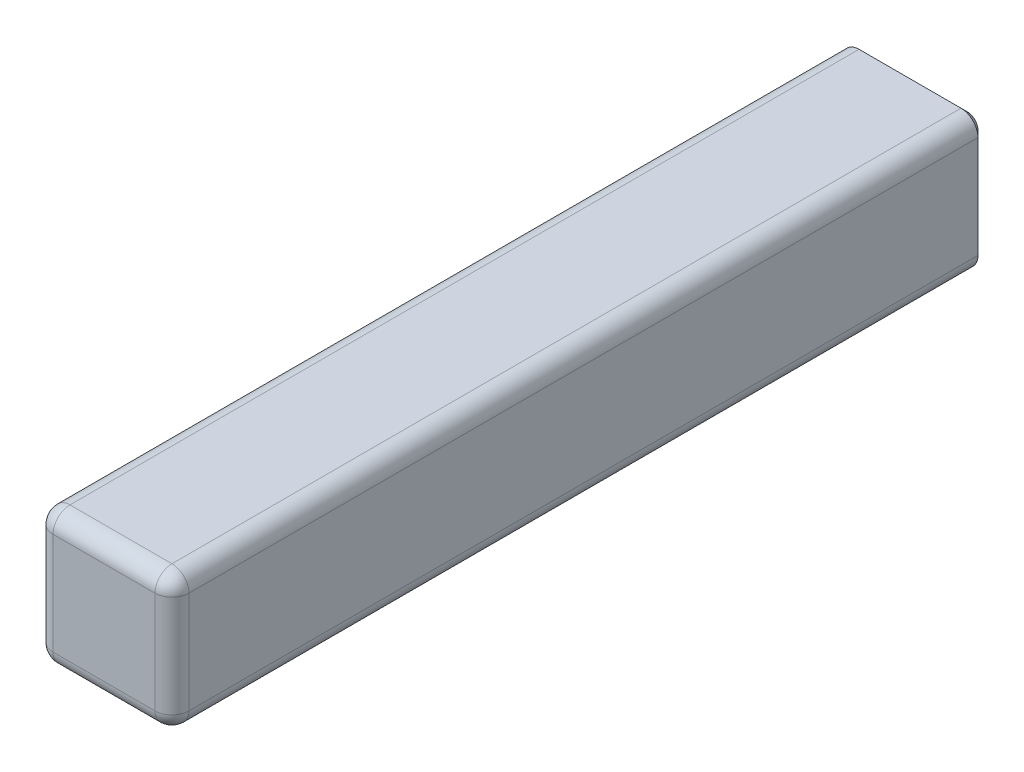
ISO-10303-21;
HEADER;
FILE_DESCRIPTION(('STEP AP214'),'2;1');
FILE_NAME('part.step','',(''),(''),'','','');
FILE_SCHEMA(('AUTOMOTIVE_DESIGN { 1 0 10303 214 1 1 1 1 }'));
ENDSEC;
DATA;
#1=APPLICATION_CONTEXT('core data for automotive mechanical design processes');
#2=APPLICATION_PROTOCOL_DEFINITION('international standard','automotive_design',2000,#1);
#3=PRODUCT_CONTEXT('',#1,'mechanical');
#4=PRODUCT('Part','Part','',(#3));
#5=PRODUCT_RELATED_PRODUCT_CATEGORY('part','',(#4));
#6=PRODUCT_DEFINITION_FORMATION('','',#4);
#7=PRODUCT_DEFINITION_CONTEXT('part definition',#1,'design');
#8=PRODUCT_DEFINITION('design','',#6,#7);
#9=PRODUCT_DEFINITION_SHAPE('','',#8);
#10=(LENGTH_UNIT() NAMED_UNIT(*) SI_UNIT(.MILLI.,.METRE.));
#11=(NAMED_UNIT(*) PLANE_ANGLE_UNIT() SI_UNIT($,.RADIAN.));
#12=(NAMED_UNIT(*) SI_UNIT($,.STERADIAN.) SOLID_ANGLE_UNIT());
#13=UNCERTAINTY_MEASURE_WITH_UNIT(LENGTH_MEASURE(1.E-05),#10,'distance_accuracy_value','');
#14=(GEOMETRIC_REPRESENTATION_CONTEXT(3) GLOBAL_UNCERTAINTY_ASSIGNED_CONTEXT((#13)) GLOBAL_UNIT_ASSIGNED_CONTEXT((#10,
#11,#12)) REPRESENTATION_CONTEXT('',''));
#15=CARTESIAN_POINT('',(0.,0.,0.));
#16=DIRECTION('',(0.,0.,1.));
#17=DIRECTION('',(1.,0.,0.));
#18=AXIS2_PLACEMENT_3D('',#15,#16,#17);
#19=CARTESIAN_POINT('',(-76.2,76.2,1366.667));
#20=DIRECTION('',(0.,0.,1.));
#21=DIRECTION('',(1.,0.,0.));
#22=AXIS2_PLACEMENT_3D('',#19,#20,#21);
#23=PLANE('',#22);
#24=DIRECTION('',(1.,0.,0.));
#25=VECTOR('',#24,1.);
#26=CARTESIAN_POINT('',(76.2,-76.2,1366.667));
#27=LINE('',#26,#25);
#28=CARTESIAN_POINT('',(-76.2,-76.2,1366.667));
#29=VERTEX_POINT('',#28);
#30=CARTESIAN_POINT('',(76.2,-76.2,1366.667));
#31=VERTEX_POINT('',#30);
#32=EDGE_CURVE('E295',#29,#31,#27,.T.);
#33=ORIENTED_EDGE('',*,*,#32,.T.);
#34=DIRECTION('',(0.,1.,0.));
#35=VECTOR('',#34,1.);
#36=CARTESIAN_POINT('',(76.2,76.2,1366.667));
#37=LINE('',#36,#35);
#38=CARTESIAN_POINT('',(76.2,76.2,1366.667));
#39=VERTEX_POINT('',#38);
#40=EDGE_CURVE('E304',#31,#39,#37,.T.);
#41=ORIENTED_EDGE('',*,*,#40,.T.);
#42=DIRECTION('',(-1.,0.,0.));
#43=VECTOR('',#42,1.);
#44=CARTESIAN_POINT('',(-76.2,76.2,1366.667));
#45=LINE('',#44,#43);
#46=CARTESIAN_POINT('',(-76.2,76.2,1366.667));
#47=VERTEX_POINT('',#46);
#48=EDGE_CURVE('E301',#39,#47,#45,.T.);
#49=ORIENTED_EDGE('',*,*,#48,.T.);
#50=DIRECTION('',(0.,-1.,0.));
#51=VECTOR('',#50,1.);
#52=CARTESIAN_POINT('',(-76.2,-76.2,1366.667));
#53=LINE('',#52,#51);
#54=EDGE_CURVE('E298',#47,#29,#53,.T.);
#55=ORIENTED_EDGE('',*,*,#54,.T.);
#56=EDGE_LOOP('',(#33,#41,#49,#55));
#57=FACE_BOUND('',#56,.T.);
#58=ADVANCED_FACE('F49',(#57),#23,.T.);
#59=CARTESIAN_POINT('',(-76.2,76.2,1366.667));
#60=DIRECTION('',(0.,0.,-1.));
#61=DIRECTION('',(-1.,0.,0.));
#62=AXIS2_PLACEMENT_3D('',#59,#60,#61);
#63=CYLINDRICAL_SURFACE('',#62,25.4);
#64=DIRECTION('',(0.,0.,-1.));
#65=VECTOR('',#64,1.);
#66=CARTESIAN_POINT('',(-76.2,101.6,1366.667));
#67=LINE('',#66,#65);
#68=CARTESIAN_POINT('',(-76.2,101.6,1341.267));
#69=VERTEX_POINT('',#68);
#70=CARTESIAN_POINT('',(-76.2,101.6,161.925));
#71=VERTEX_POINT('',#70);
#72=EDGE_CURVE('E262',#69,#71,#67,.T.);
#73=ORIENTED_EDGE('',*,*,#72,.T.);
#74=CARTESIAN_POINT('',(-76.2,76.2,161.925));
#75=DIRECTION('',(0.,0.,1.));
#76=DIRECTION('',(1.,0.,0.));
#77=AXIS2_PLACEMENT_3D('',#74,#75,#76);
#78=CIRCLE('',#77,25.4);
#79=CARTESIAN_POINT('',(-101.6,76.2,161.925));
#80=VERTEX_POINT('',#79);
#81=EDGE_CURVE('E329',#71,#80,#78,.T.);
#82=ORIENTED_EDGE('',*,*,#81,.T.);
#83=DIRECTION('',(0.,0.,-1.));
#84=VECTOR('',#83,1.);
#85=CARTESIAN_POINT('',(-101.6,76.2,1366.667));
#86=LINE('',#85,#84);
#87=CARTESIAN_POINT('',(-101.6,76.2,1341.267));
#88=VERTEX_POINT('',#87);
#89=EDGE_CURVE('E287',#88,#80,#86,.T.);
#90=ORIENTED_EDGE('',*,*,#89,.F.);
#91=CARTESIAN_POINT('',(-76.2,76.2,1341.267));
#92=DIRECTION('',(0.,0.,-1.));
#93=DIRECTION('',(-1.,0.,0.));
#94=AXIS2_PLACEMENT_3D('',#91,#92,#93);
#95=CIRCLE('',#94,25.4);
#96=EDGE_CURVE('E317',#88,#69,#95,.T.);
#97=ORIENTED_EDGE('',*,*,#96,.T.);
#98=EDGE_LOOP('',(#73,#82,#90,#97));
#99=FACE_BOUND('',#98,.T.);
#100=ADVANCED_FACE('F459',(#99),#63,.T.);
#101=CARTESIAN_POINT('',(-101.6,76.2,1366.667));
#102=DIRECTION('',(1.,0.,0.));
#103=DIRECTION('',(0.,1.,0.));
#104=AXIS2_PLACEMENT_3D('',#101,#102,#103);
#105=PLANE('',#104);
#106=ORIENTED_EDGE('',*,*,#89,.T.);
#107=DIRECTION('',(0.,-1.,0.));
#108=VECTOR('',#107,1.);
#109=CARTESIAN_POINT('',(-101.6,76.2,161.925));
#110=LINE('',#109,#108);
#111=CARTESIAN_POINT('',(-101.6,-76.2,161.925));
#112=VERTEX_POINT('',#111);
#113=EDGE_CURVE('E388',#80,#112,#110,.T.);
#114=ORIENTED_EDGE('',*,*,#113,.T.);
#115=DIRECTION('',(0.,0.,-1.));
#116=VECTOR('',#115,1.);
#117=CARTESIAN_POINT('',(-101.6,-76.2,1366.667));
#118=LINE('',#117,#116);
#119=CARTESIAN_POINT('',(-101.6,-76.2,1341.267));
#120=VERTEX_POINT('',#119);
#121=EDGE_CURVE('E283',#120,#112,#118,.T.);
#122=ORIENTED_EDGE('',*,*,#121,.F.);
#123=DIRECTION('',(0.,-1.,0.));
#124=VECTOR('',#123,1.);
#125=CARTESIAN_POINT('',(-101.6,76.2,1341.267));
#126=LINE('',#125,#124);
#127=EDGE_CURVE('E320',#120,#88,#126,.F.);
#128=ORIENTED_EDGE('',*,*,#127,.T.);
#129=EDGE_LOOP('',(#106,#114,#122,#128));
#130=FACE_BOUND('',#129,.T.);
#131=ADVANCED_FACE('F517',(#130),#105,.F.);
#132=CARTESIAN_POINT('',(-76.2,-76.2,1366.667));
#133=DIRECTION('',(0.,0.,-1.));
#134=DIRECTION('',(-1.,0.,0.));
#135=AXIS2_PLACEMENT_3D('',#132,#133,#134);
#136=CYLINDRICAL_SURFACE('',#135,25.4);
#137=ORIENTED_EDGE('',*,*,#121,.T.);
#138=CARTESIAN_POINT('',(-76.2,-76.2,161.925));
#139=DIRECTION('',(0.,0.,1.));
#140=DIRECTION('',(1.,0.,0.));
#141=AXIS2_PLACEMENT_3D('',#138,#139,#140);
#142=CIRCLE('',#141,25.4);
#143=CARTESIAN_POINT('',(-76.2,-101.6,161.925));
#144=VERTEX_POINT('',#143);
#145=EDGE_CURVE('E391',#112,#144,#142,.T.);
#146=ORIENTED_EDGE('',*,*,#145,.T.);
#147=DIRECTION('',(0.,0.,-1.));
#148=VECTOR('',#147,1.);
#149=CARTESIAN_POINT('',(-76.2,-101.6,1366.667));
#150=LINE('',#149,#148);
#151=CARTESIAN_POINT('',(-76.2,-101.6,1341.267));
#152=VERTEX_POINT('',#151);
#153=EDGE_CURVE('E279',#152,#144,#150,.T.);
#154=ORIENTED_EDGE('',*,*,#153,.F.);
#155=CARTESIAN_POINT('',(-76.2,-76.2,1341.267));
#156=DIRECTION('',(0.,0.,-1.));
#157=DIRECTION('',(-1.,0.,0.));
#158=AXIS2_PLACEMENT_3D('',#155,#156,#157);
#159=CIRCLE('',#158,25.4);
#160=EDGE_CURVE('E323',#152,#120,#159,.T.);
#161=ORIENTED_EDGE('',*,*,#160,.T.);
#162=EDGE_LOOP('',(#137,#146,#154,#161));
#163=FACE_BOUND('',#162,.T.);
#164=ADVANCED_FACE('F519',(#163),#136,.T.);
#165=CARTESIAN_POINT('',(76.2,-101.6,1366.667));
#166=DIRECTION('',(0.,1.,0.));
#167=DIRECTION('',(0.,0.,1.));
#168=AXIS2_PLACEMENT_3D('',#165,#166,#167);
#169=PLANE('',#168);
#170=ORIENTED_EDGE('',*,*,#153,.T.);
#171=DIRECTION('',(1.,0.,0.));
#172=VECTOR('',#171,1.);
#173=CARTESIAN_POINT('',(76.2,-101.6,161.925));
#174=LINE('',#173,#172);
#175=CARTESIAN_POINT('',(76.2,-101.6,161.925));
#176=VERTEX_POINT('',#175);
#177=EDGE_CURVE('E394',#144,#176,#174,.T.);
#178=ORIENTED_EDGE('',*,*,#177,.T.);
#179=DIRECTION('',(0.,0.,-1.));
#180=VECTOR('',#179,1.);
#181=CARTESIAN_POINT('',(76.2,-101.6,1366.667));
#182=LINE('',#181,#180);
#183=CARTESIAN_POINT('',(76.2,-101.6,1341.267));
#184=VERTEX_POINT('',#183);
#185=EDGE_CURVE('E275',#184,#176,#182,.T.);
#186=ORIENTED_EDGE('',*,*,#185,.F.);
#187=DIRECTION('',(1.,0.,0.));
#188=VECTOR('',#187,1.);
#189=CARTESIAN_POINT('',(-76.2,-101.6,1341.267));
#190=LINE('',#189,#188);
#191=EDGE_CURVE('E326',#184,#152,#190,.F.);
#192=ORIENTED_EDGE('',*,*,#191,.T.);
#193=EDGE_LOOP('',(#170,#178,#186,#192));
#194=FACE_BOUND('',#193,.T.);
#195=ADVANCED_FACE('F499',(#194),#169,.F.);
#196=CARTESIAN_POINT('',(76.2,-76.2,1366.667));
#197=DIRECTION('',(0.,0.,-1.));
#198=DIRECTION('',(-1.,0.,0.));
#199=AXIS2_PLACEMENT_3D('',#196,#197,#198);
#200=CYLINDRICAL_SURFACE('',#199,25.4);
#201=ORIENTED_EDGE('',*,*,#185,.T.);
#202=CARTESIAN_POINT('',(76.2,-76.2,161.925));
#203=DIRECTION('',(0.,0.,1.));
#204=DIRECTION('',(1.,0.,0.));
#205=AXIS2_PLACEMENT_3D('',#202,#203,#204);
#206=CIRCLE('',#205,25.4);
#207=CARTESIAN_POINT('',(101.6,-76.2,161.925));
#208=VERTEX_POINT('',#207);
#209=EDGE_CURVE('E397',#176,#208,#206,.T.);
#210=ORIENTED_EDGE('',*,*,#209,.T.);
#211=DIRECTION('',(0.,0.,-1.));
#212=VECTOR('',#211,1.);
#213=CARTESIAN_POINT('',(101.6,-76.2,1366.667));
#214=LINE('',#213,#212);
#215=CARTESIAN_POINT('',(101.6,-76.2,1341.267));
#216=VERTEX_POINT('',#215);
#217=EDGE_CURVE('E272',#216,#208,#214,.T.);
#218=ORIENTED_EDGE('',*,*,#217,.F.);
#219=CARTESIAN_POINT('',(76.2,-76.2,1341.267));
#220=DIRECTION('',(0.,0.,-1.));
#221=DIRECTION('',(-1.,0.,0.));
#222=AXIS2_PLACEMENT_3D('',#219,#220,#221);
#223=CIRCLE('',#222,25.4);
#224=EDGE_CURVE('E291',#216,#184,#223,.T.);
#225=ORIENTED_EDGE('',*,*,#224,.T.);
#226=EDGE_LOOP('',(#201,#210,#218,#225));
#227=FACE_BOUND('',#226,.T.);
#228=ADVANCED_FACE('F497',(#227),#200,.T.);
#229=CARTESIAN_POINT('',(101.6,-76.2,1366.667));
#230=DIRECTION('',(-1.,0.,0.));
#231=DIRECTION('',(0.,0.,1.));
#232=AXIS2_PLACEMENT_3D('',#229,#230,#231);
#233=PLANE('',#232);
#234=ORIENTED_EDGE('',*,*,#217,.T.);
#235=DIRECTION('',(0.,1.,0.));
#236=VECTOR('',#235,1.);
#237=CARTESIAN_POINT('',(101.6,-76.2,161.925));
#238=LINE('',#237,#236);
#239=CARTESIAN_POINT('',(101.6,76.2,161.925));
#240=VERTEX_POINT('',#239);
#241=EDGE_CURVE('E75',#208,#240,#238,.T.);
#242=ORIENTED_EDGE('',*,*,#241,.T.);
#243=DIRECTION('',(0.,0.,-1.));
#244=VECTOR('',#243,1.);
#245=CARTESIAN_POINT('',(101.6,76.2,1366.667));
#246=LINE('',#245,#244);
#247=CARTESIAN_POINT('',(101.6,76.2,1341.267));
#248=VERTEX_POINT('',#247);
#249=EDGE_CURVE('E269',#248,#240,#246,.T.);
#250=ORIENTED_EDGE('',*,*,#249,.F.);
#251=DIRECTION('',(0.,1.,0.));
#252=VECTOR('',#251,1.);
#253=CARTESIAN_POINT('',(101.6,-76.2,1341.267));
#254=LINE('',#253,#252);
#255=EDGE_CURVE('E308',#248,#216,#254,.F.);
#256=ORIENTED_EDGE('',*,*,#255,.T.);
#257=EDGE_LOOP('',(#234,#242,#250,#256));
#258=FACE_BOUND('',#257,.T.);
#259=ADVANCED_FACE('F483',(#258),#233,.F.);
#260=CARTESIAN_POINT('',(76.2,76.2,1366.667));
#261=DIRECTION('',(0.,0.,-1.));
#262=DIRECTION('',(-1.,0.,0.));
#263=AXIS2_PLACEMENT_3D('',#260,#261,#262);
#264=CYLINDRICAL_SURFACE('',#263,25.4);
#265=ORIENTED_EDGE('',*,*,#249,.T.);
#266=CARTESIAN_POINT('',(76.2,76.2,161.925));
#267=DIRECTION('',(0.,0.,1.));
#268=DIRECTION('',(1.,0.,0.));
#269=AXIS2_PLACEMENT_3D('',#266,#267,#268);
#270=CIRCLE('',#269,25.4);
#271=CARTESIAN_POINT('',(76.2,101.6,161.925));
#272=VERTEX_POINT('',#271);
#273=EDGE_CURVE('E60',#240,#272,#270,.T.);
#274=ORIENTED_EDGE('',*,*,#273,.T.);
#275=DIRECTION('',(0.,0.,-1.));
#276=VECTOR('',#275,1.);
#277=CARTESIAN_POINT('',(76.2,101.6,1366.667));
#278=LINE('',#277,#276);
#279=CARTESIAN_POINT('',(76.2,101.6,1341.267));
#280=VERTEX_POINT('',#279);
#281=EDGE_CURVE('E266',#280,#272,#278,.T.);
#282=ORIENTED_EDGE('',*,*,#281,.F.);
#283=CARTESIAN_POINT('',(76.2,76.2,1341.267));
#284=DIRECTION('',(0.,0.,-1.));
#285=DIRECTION('',(-1.,0.,0.));
#286=AXIS2_PLACEMENT_3D('',#283,#284,#285);
#287=CIRCLE('',#286,25.4);
#288=EDGE_CURVE('E311',#280,#248,#287,.T.);
#289=ORIENTED_EDGE('',*,*,#288,.T.);
#290=EDGE_LOOP('',(#265,#274,#282,#289));
#291=FACE_BOUND('',#290,.T.);
#292=ADVANCED_FACE('F480',(#291),#264,.T.);
#293=CARTESIAN_POINT('',(-76.2,101.6,1366.667));
#294=DIRECTION('',(0.,-1.,0.));
#295=DIRECTION('',(0.,0.,-1.));
#296=AXIS2_PLACEMENT_3D('',#293,#294,#295);
#297=PLANE('',#296);
#298=ORIENTED_EDGE('',*,*,#281,.T.);
#299=DIRECTION('',(-1.,0.,0.));
#300=VECTOR('',#299,1.);
#301=CARTESIAN_POINT('',(-76.2,101.6,161.925));
#302=LINE('',#301,#300);
#303=EDGE_CURVE('E11',#272,#71,#302,.T.);
#304=ORIENTED_EDGE('',*,*,#303,.T.);
#305=ORIENTED_EDGE('',*,*,#72,.F.);
#306=DIRECTION('',(-1.,0.,0.));
#307=VECTOR('',#306,1.);
#308=CARTESIAN_POINT('',(76.2,101.6,1341.267));
#309=LINE('',#308,#307);
#310=EDGE_CURVE('E314',#69,#280,#309,.F.);
#311=ORIENTED_EDGE('',*,*,#310,.T.);
#312=EDGE_LOOP('',(#298,#304,#305,#311));
#313=FACE_BOUND('',#312,.T.);
#314=ADVANCED_FACE('F456',(#313),#297,.F.);
#315=CARTESIAN_POINT('',(-76.2,76.2,1341.267));
#316=DIRECTION('',(0.,0.,1.));
#317=DIRECTION('',(1.,0.,0.));
#318=AXIS2_PLACEMENT_3D('',#315,#316,#317);
#319=SPHERICAL_SURFACE('',#318,25.4);
#320=CARTESIAN_POINT('',(-76.2,76.2,1341.267));
#321=DIRECTION('',(1.,0.,0.));
#322=DIRECTION('',(0.,0.,-1.));
#323=AXIS2_PLACEMENT_3D('',#320,#321,#322);
#324=CIRCLE('',#323,25.4);
#325=EDGE_CURVE('E351',#69,#47,#324,.T.);
#326=ORIENTED_EDGE('',*,*,#325,.F.);
#327=ORIENTED_EDGE('',*,*,#96,.F.);
#328=CARTESIAN_POINT('',(-76.2,76.2,1341.267));
#329=DIRECTION('',(0.,-1.,0.));
#330=DIRECTION('',(0.,0.,-1.));
#331=AXIS2_PLACEMENT_3D('',#328,#329,#330);
#332=CIRCLE('',#331,25.4);
#333=EDGE_CURVE('E355',#47,#88,#332,.T.);
#334=ORIENTED_EDGE('',*,*,#333,.F.);
#335=EDGE_LOOP('',(#326,#327,#334));
#336=FACE_BOUND('',#335,.T.);
#337=ADVANCED_FACE('F464',(#336),#319,.T.);
#338=CARTESIAN_POINT('',(-76.2,76.2,1341.267));
#339=DIRECTION('',(0.,1.,0.));
#340=DIRECTION('',(-1.,0.,0.));
#341=AXIS2_PLACEMENT_3D('',#338,#339,#340);
#342=CYLINDRICAL_SURFACE('',#341,25.4);
#343=ORIENTED_EDGE('',*,*,#333,.T.);
#344=ORIENTED_EDGE('',*,*,#127,.F.);
#345=CARTESIAN_POINT('',(-76.2,-76.2,1341.267));
#346=DIRECTION('',(0.,-1.,0.));
#347=DIRECTION('',(0.,0.,-1.));
#348=AXIS2_PLACEMENT_3D('',#345,#346,#347);
#349=CIRCLE('',#348,25.4);
#350=EDGE_CURVE('E347',#29,#120,#349,.T.);
#351=ORIENTED_EDGE('',*,*,#350,.F.);
#352=ORIENTED_EDGE('',*,*,#54,.F.);
#353=EDGE_LOOP('',(#343,#344,#351,#352));
#354=FACE_BOUND('',#353,.T.);
#355=ADVANCED_FACE('F469',(#354),#342,.T.);
#356=CARTESIAN_POINT('',(-76.2,76.2,1341.267));
#357=DIRECTION('',(1.,0.,0.));
#358=DIRECTION('',(0.,0.,-1.));
#359=AXIS2_PLACEMENT_3D('',#356,#357,#358);
#360=CYLINDRICAL_SURFACE('',#359,25.4);
#361=ORIENTED_EDGE('',*,*,#325,.T.);
#362=ORIENTED_EDGE('',*,*,#48,.F.);
#363=CARTESIAN_POINT('',(76.2,76.2,1341.267));
#364=DIRECTION('',(1.,0.,0.));
#365=DIRECTION('',(0.,0.,-1.));
#366=AXIS2_PLACEMENT_3D('',#363,#364,#365);
#367=CIRCLE('',#366,25.4);
#368=EDGE_CURVE('E343',#280,#39,#367,.T.);
#369=ORIENTED_EDGE('',*,*,#368,.F.);
#370=ORIENTED_EDGE('',*,*,#310,.F.);
#371=EDGE_LOOP('',(#361,#362,#369,#370));
#372=FACE_BOUND('',#371,.T.);
#373=ADVANCED_FACE('F478',(#372),#360,.T.);
#374=CARTESIAN_POINT('',(-76.2,-76.2,1341.267));
#375=DIRECTION('',(0.,0.,1.));
#376=DIRECTION('',(1.,0.,0.));
#377=AXIS2_PLACEMENT_3D('',#374,#375,#376);
#378=SPHERICAL_SURFACE('',#377,25.4);
#379=ORIENTED_EDGE('',*,*,#350,.T.);
#380=ORIENTED_EDGE('',*,*,#160,.F.);
#381=CARTESIAN_POINT('',(-76.2,-76.2,1341.267));
#382=DIRECTION('',(1.,0.,0.));
#383=DIRECTION('',(0.,0.,-1.));
#384=AXIS2_PLACEMENT_3D('',#381,#382,#383);
#385=CIRCLE('',#384,25.4);
#386=EDGE_CURVE('E339',#29,#152,#385,.T.);
#387=ORIENTED_EDGE('',*,*,#386,.F.);
#388=EDGE_LOOP('',(#379,#380,#387));
#389=FACE_BOUND('',#388,.T.);
#390=ADVANCED_FACE('F522',(#389),#378,.T.);
#391=CARTESIAN_POINT('',(76.2,76.2,1341.267));
#392=DIRECTION('',(0.,0.,1.));
#393=DIRECTION('',(1.,0.,0.));
#394=AXIS2_PLACEMENT_3D('',#391,#392,#393);
#395=SPHERICAL_SURFACE('',#394,25.4);
#396=ORIENTED_EDGE('',*,*,#288,.F.);
#397=ORIENTED_EDGE('',*,*,#368,.T.);
#398=CARTESIAN_POINT('',(76.2,76.2,1341.267));
#399=DIRECTION('',(0.,-1.,0.));
#400=DIRECTION('',(0.,0.,-1.));
#401=AXIS2_PLACEMENT_3D('',#398,#399,#400);
#402=CIRCLE('',#401,25.4);
#403=EDGE_CURVE('E336',#248,#39,#402,.T.);
#404=ORIENTED_EDGE('',*,*,#403,.F.);
#405=EDGE_LOOP('',(#396,#397,#404));
#406=FACE_BOUND('',#405,.T.);
#407=ADVANCED_FACE('F486',(#406),#395,.T.);
#408=CARTESIAN_POINT('',(-76.2,-76.2,1341.267));
#409=DIRECTION('',(-1.,0.,0.));
#410=DIRECTION('',(0.,0.,1.));
#411=AXIS2_PLACEMENT_3D('',#408,#409,#410);
#412=CYLINDRICAL_SURFACE('',#411,25.4);
#413=ORIENTED_EDGE('',*,*,#386,.T.);
#414=ORIENTED_EDGE('',*,*,#191,.F.);
#415=CARTESIAN_POINT('',(76.2,-76.2,1341.267));
#416=DIRECTION('',(1.,0.,0.));
#417=DIRECTION('',(0.,0.,-1.));
#418=AXIS2_PLACEMENT_3D('',#415,#416,#417);
#419=CIRCLE('',#418,25.4);
#420=EDGE_CURVE('E333',#31,#184,#419,.T.);
#421=ORIENTED_EDGE('',*,*,#420,.F.);
#422=ORIENTED_EDGE('',*,*,#32,.F.);
#423=EDGE_LOOP('',(#413,#414,#421,#422));
#424=FACE_BOUND('',#423,.T.);
#425=ADVANCED_FACE('F524',(#424),#412,.T.);
#426=CARTESIAN_POINT('',(76.2,76.2,1341.267));
#427=DIRECTION('',(0.,-1.,0.));
#428=DIRECTION('',(0.,0.,-1.));
#429=AXIS2_PLACEMENT_3D('',#426,#427,#428);
#430=CYLINDRICAL_SURFACE('',#429,25.4);
#431=ORIENTED_EDGE('',*,*,#403,.T.);
#432=ORIENTED_EDGE('',*,*,#40,.F.);
#433=CARTESIAN_POINT('',(76.2,-76.2,1341.267));
#434=DIRECTION('',(0.,-1.,0.));
#435=DIRECTION('',(0.,0.,-1.));
#436=AXIS2_PLACEMENT_3D('',#433,#434,#435);
#437=CIRCLE('',#436,25.4);
#438=EDGE_CURVE('E224',#216,#31,#437,.T.);
#439=ORIENTED_EDGE('',*,*,#438,.F.);
#440=ORIENTED_EDGE('',*,*,#255,.F.);
#441=EDGE_LOOP('',(#431,#432,#439,#440));
#442=FACE_BOUND('',#441,.T.);
#443=ADVANCED_FACE('F489',(#442),#430,.T.);
#444=CARTESIAN_POINT('',(76.2,-76.2,1341.267));
#445=DIRECTION('',(0.,0.,1.));
#446=DIRECTION('',(1.,0.,0.));
#447=AXIS2_PLACEMENT_3D('',#444,#445,#446);
#448=SPHERICAL_SURFACE('',#447,25.4);
#449=ORIENTED_EDGE('',*,*,#420,.T.);
#450=ORIENTED_EDGE('',*,*,#224,.F.);
#451=ORIENTED_EDGE('',*,*,#438,.T.);
#452=EDGE_LOOP('',(#449,#450,#451));
#453=FACE_BOUND('',#452,.T.);
#454=ADVANCED_FACE('F493',(#453),#448,.T.);
#455=CARTESIAN_POINT('',(258.05498802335,-101.6,152.4));
#456=DIRECTION('',(0.,0.,1.));
#457=DIRECTION('',(1.,0.,0.));
#458=AXIS2_PLACEMENT_3D('',#455,#456,#457);
#459=PLANE('',#458);
#460=DIRECTION('',(0.,1.,0.));
#461=VECTOR('',#460,1.);
#462=CARTESIAN_POINT('',(-92.0749999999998,-101.6,152.4));
#463=LINE('',#462,#461);
#464=CARTESIAN_POINT('',(-92.0749999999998,-76.2,152.4));
#465=VERTEX_POINT('',#464);
#466=CARTESIAN_POINT('',(-92.0749999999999,76.2,152.4));
#467=VERTEX_POINT('',#466);
#468=EDGE_CURVE('E381',#465,#467,#463,.T.);
#469=ORIENTED_EDGE('',*,*,#468,.T.);
#470=CARTESIAN_POINT('',(-76.2,76.2,152.4));
#471=DIRECTION('',(0.,0.,1.));
#472=DIRECTION('',(1.,0.,0.));
#473=AXIS2_PLACEMENT_3D('',#470,#471,#472);
#474=CIRCLE('',#473,15.8749999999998);
#475=CARTESIAN_POINT('',(-76.2,92.0749999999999,152.4));
#476=VERTEX_POINT('',#475);
#477=EDGE_CURVE('E384',#467,#476,#474,.F.);
#478=ORIENTED_EDGE('',*,*,#477,.T.);
#479=DIRECTION('',(1.,0.,0.));
#480=VECTOR('',#479,1.);
#481=CARTESIAN_POINT('',(258.05498802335,92.0749999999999,152.4));
#482=LINE('',#481,#480);
#483=CARTESIAN_POINT('',(76.2,92.0749999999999,152.4));
#484=VERTEX_POINT('',#483);
#485=EDGE_CURVE('E363',#476,#484,#482,.T.);
#486=ORIENTED_EDGE('',*,*,#485,.T.);
#487=CARTESIAN_POINT('',(76.2,76.2,152.4));
#488=DIRECTION('',(0.,0.,1.));
#489=DIRECTION('',(1.,0.,0.));
#490=AXIS2_PLACEMENT_3D('',#487,#488,#489);
#491=CIRCLE('',#490,15.8749999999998);
#492=CARTESIAN_POINT('',(92.0749999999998,76.2,152.4));
#493=VERTEX_POINT('',#492);
#494=EDGE_CURVE('E366',#484,#493,#491,.F.);
#495=ORIENTED_EDGE('',*,*,#494,.T.);
#496=DIRECTION('',(0.,-1.,0.));
#497=VECTOR('',#496,1.);
#498=CARTESIAN_POINT('',(92.0749999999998,-101.6,152.4));
#499=LINE('',#498,#497);
#500=CARTESIAN_POINT('',(92.0749999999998,-76.2,152.4));
#501=VERTEX_POINT('',#500);
#502=EDGE_CURVE('E369',#493,#501,#499,.T.);
#503=ORIENTED_EDGE('',*,*,#502,.T.);
#504=CARTESIAN_POINT('',(76.2,-76.2,152.4));
#505=DIRECTION('',(0.,0.,1.));
#506=DIRECTION('',(1.,0.,0.));
#507=AXIS2_PLACEMENT_3D('',#504,#505,#506);
#508=CIRCLE('',#507,15.8749999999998);
#509=CARTESIAN_POINT('',(76.2,-92.0749999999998,152.4));
#510=VERTEX_POINT('',#509);
#511=EDGE_CURVE('E372',#501,#510,#508,.F.);
#512=ORIENTED_EDGE('',*,*,#511,.T.);
#513=DIRECTION('',(-1.,0.,0.));
#514=VECTOR('',#513,1.);
#515=CARTESIAN_POINT('',(258.05498802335,-92.0749999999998,152.4));
#516=LINE('',#515,#514);
#517=CARTESIAN_POINT('',(-76.2,-92.0749999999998,152.4));
#518=VERTEX_POINT('',#517);
#519=EDGE_CURVE('E375',#510,#518,#516,.T.);
#520=ORIENTED_EDGE('',*,*,#519,.T.);
#521=CARTESIAN_POINT('',(-76.2,-76.2,152.4));
#522=DIRECTION('',(0.,0.,1.));
#523=DIRECTION('',(1.,0.,0.));
#524=AXIS2_PLACEMENT_3D('',#521,#522,#523);
#525=CIRCLE('',#524,15.8749999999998);
#526=EDGE_CURVE('E378',#518,#465,#525,.F.);
#527=ORIENTED_EDGE('',*,*,#526,.T.);
#528=EDGE_LOOP('',(#469,#478,#486,#495,#503,#512,#520,#527));
#529=FACE_BOUND('',#528,.T.);
#530=CARTESIAN_POINT('',(-76.2,-76.2,152.4));
#531=DIRECTION('',(0.,0.,1.));
#532=DIRECTION('',(1.,0.,0.));
#533=AXIS2_PLACEMENT_3D('',#530,#531,#532);
#534=CIRCLE('',#533,12.7);
#535=CARTESIAN_POINT('',(-88.9,-76.2,152.4));
#536=VERTEX_POINT('',#535);
#537=CARTESIAN_POINT('',(-76.2,-88.9,152.4));
#538=VERTEX_POINT('',#537);
#539=EDGE_CURVE('E205',#536,#538,#534,.T.);
#540=ORIENTED_EDGE('',*,*,#539,.T.);
#541=DIRECTION('',(1.,0.,0.));
#542=VECTOR('',#541,1.);
#543=CARTESIAN_POINT('',(76.2,-88.9,152.4));
#544=LINE('',#543,#542);
#545=CARTESIAN_POINT('',(76.1999999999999,-88.9,152.4));
#546=VERTEX_POINT('',#545);
#547=EDGE_CURVE('E225',#538,#546,#544,.T.);
#548=ORIENTED_EDGE('',*,*,#547,.T.);
#549=CARTESIAN_POINT('',(76.2,-76.2,152.4));
#550=DIRECTION('',(0.,0.,1.));
#551=DIRECTION('',(1.,0.,0.));
#552=AXIS2_PLACEMENT_3D('',#549,#550,#551);
#553=CIRCLE('',#552,12.7);
#554=CARTESIAN_POINT('',(88.9,-76.2,152.4));
#555=VERTEX_POINT('',#554);
#556=EDGE_CURVE('E601',#546,#555,#553,.T.);
#557=ORIENTED_EDGE('',*,*,#556,.T.);
#558=DIRECTION('',(0.,1.,0.));
#559=VECTOR('',#558,1.);
#560=CARTESIAN_POINT('',(88.9,-76.2,152.4));
#561=LINE('',#560,#559);
#562=CARTESIAN_POINT('',(88.9,76.2,152.4));
#563=VERTEX_POINT('',#562);
#564=EDGE_CURVE('E604',#555,#563,#561,.T.);
#565=ORIENTED_EDGE('',*,*,#564,.T.);
#566=CARTESIAN_POINT('',(76.2,76.2,152.4));
#567=DIRECTION('',(0.,0.,1.));
#568=DIRECTION('',(1.,0.,0.));
#569=AXIS2_PLACEMENT_3D('',#566,#567,#568);
#570=CIRCLE('',#569,12.7);
#571=CARTESIAN_POINT('',(76.2,88.9,152.4));
#572=VERTEX_POINT('',#571);
#573=EDGE_CURVE('E636',#563,#572,#570,.T.);
#574=ORIENTED_EDGE('',*,*,#573,.T.);
#575=DIRECTION('',(-1.,0.,0.));
#576=VECTOR('',#575,1.);
#577=CARTESIAN_POINT('',(-76.2,88.9,152.4));
#578=LINE('',#577,#576);
#579=CARTESIAN_POINT('',(-76.2,88.9,152.4));
#580=VERTEX_POINT('',#579);
#581=EDGE_CURVE('E633',#572,#580,#578,.T.);
#582=ORIENTED_EDGE('',*,*,#581,.T.);
#583=CARTESIAN_POINT('',(-76.2,76.2,152.4));
#584=DIRECTION('',(0.,0.,1.));
#585=DIRECTION('',(1.,0.,0.));
#586=AXIS2_PLACEMENT_3D('',#583,#584,#585);
#587=CIRCLE('',#586,12.7);
#588=CARTESIAN_POINT('',(-88.9000000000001,76.2,152.4));
#589=VERTEX_POINT('',#588);
#590=EDGE_CURVE('E208',#580,#589,#587,.T.);
#591=ORIENTED_EDGE('',*,*,#590,.T.);
#592=DIRECTION('',(0.,-1.,0.));
#593=VECTOR('',#592,1.);
#594=CARTESIAN_POINT('',(-88.9000000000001,76.2,152.4));
#595=LINE('',#594,#593);
#596=EDGE_CURVE('E202',#589,#536,#595,.T.);
#597=ORIENTED_EDGE('',*,*,#596,.T.);
#598=EDGE_LOOP('',(#540,#548,#557,#565,#574,#582,#591,#597));
#599=FACE_BOUND('',#598,.T.);
#600=ADVANCED_FACE('F204',(#529,#599),#459,.F.);
#601=CARTESIAN_POINT('',(-76.2,-76.2,1341.267));
#602=DIRECTION('',(0.,0.,1.));
#603=DIRECTION('',(1.,0.,0.));
#604=AXIS2_PLACEMENT_3D('',#601,#602,#603);
#605=PLANE('',#604);
#606=CARTESIAN_POINT('',(-76.2,-76.2,1341.267));
#607=DIRECTION('',(0.,0.,1.));
#608=DIRECTION('',(1.,0.,0.));
#609=AXIS2_PLACEMENT_3D('',#606,#607,#608);
#610=CIRCLE('',#609,12.7);
#611=CARTESIAN_POINT('',(-88.9,-76.2,1341.267));
#612=VERTEX_POINT('',#611);
#613=CARTESIAN_POINT('',(-76.1999999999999,-88.9,1341.267));
#614=VERTEX_POINT('',#613);
#615=EDGE_CURVE('E359',#612,#614,#610,.T.);
#616=ORIENTED_EDGE('',*,*,#615,.F.);
#617=DIRECTION('',(0.,-1.,0.));
#618=VECTOR('',#617,1.);
#619=CARTESIAN_POINT('',(-88.9000000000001,76.1999999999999,1341.267));
#620=LINE('',#619,#618);
#621=CARTESIAN_POINT('',(-88.9000000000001,76.1999999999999,1341.267));
#622=VERTEX_POINT('',#621);
#623=EDGE_CURVE('E229',#622,#612,#620,.T.);
#624=ORIENTED_EDGE('',*,*,#623,.F.);
#625=CARTESIAN_POINT('',(-76.2000000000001,76.2,1341.267));
#626=DIRECTION('',(0.,0.,1.));
#627=DIRECTION('',(1.,0.,0.));
#628=AXIS2_PLACEMENT_3D('',#625,#626,#627);
#629=CIRCLE('',#628,12.7);
#630=CARTESIAN_POINT('',(-76.2,88.9,1341.267));
#631=VERTEX_POINT('',#630);
#632=EDGE_CURVE('E237',#631,#622,#629,.T.);
#633=ORIENTED_EDGE('',*,*,#632,.F.);
#634=DIRECTION('',(-1.,0.,0.));
#635=VECTOR('',#634,1.);
#636=CARTESIAN_POINT('',(-76.2,88.9,1341.267));
#637=LINE('',#636,#635);
#638=CARTESIAN_POINT('',(76.1999999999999,88.9,1341.267));
#639=VERTEX_POINT('',#638);
#640=EDGE_CURVE('E625',#639,#631,#637,.T.);
#641=ORIENTED_EDGE('',*,*,#640,.F.);
#642=CARTESIAN_POINT('',(76.2,76.2,1341.267));
#643=DIRECTION('',(0.,0.,1.));
#644=DIRECTION('',(1.,0.,0.));
#645=AXIS2_PLACEMENT_3D('',#642,#643,#644);
#646=CIRCLE('',#645,12.7);
#647=CARTESIAN_POINT('',(88.9,76.1999999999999,1341.267));
#648=VERTEX_POINT('',#647);
#649=EDGE_CURVE('E621',#648,#639,#646,.T.);
#650=ORIENTED_EDGE('',*,*,#649,.F.);
#651=DIRECTION('',(0.,1.,0.));
#652=VECTOR('',#651,1.);
#653=CARTESIAN_POINT('',(88.8999999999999,-76.1999999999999,1341.267));
#654=LINE('',#653,#652);
#655=CARTESIAN_POINT('',(88.8999999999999,-76.1999999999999,1341.267));
#656=VERTEX_POINT('',#655);
#657=EDGE_CURVE('E617',#656,#648,#654,.T.);
#658=ORIENTED_EDGE('',*,*,#657,.F.);
#659=CARTESIAN_POINT('',(76.2,-76.2,1341.267));
#660=DIRECTION('',(0.,0.,1.));
#661=DIRECTION('',(-1.,0.,0.));
#662=AXIS2_PLACEMENT_3D('',#659,#660,#661);
#663=CIRCLE('',#662,12.7);
#664=CARTESIAN_POINT('',(76.1999999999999,-88.9,1341.267));
#665=VERTEX_POINT('',#664);
#666=EDGE_CURVE('E613',#665,#656,#663,.T.);
#667=ORIENTED_EDGE('',*,*,#666,.F.);
#668=DIRECTION('',(1.,0.,0.));
#669=VECTOR('',#668,1.);
#670=CARTESIAN_POINT('',(-76.1999999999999,-88.9,1341.267));
#671=LINE('',#670,#669);
#672=EDGE_CURVE('E610',#614,#665,#671,.T.);
#673=ORIENTED_EDGE('',*,*,#672,.F.);
#674=EDGE_LOOP('',(#616,#624,#633,#641,#650,#658,#667,#673));
#675=FACE_BOUND('',#674,.T.);
#676=ADVANCED_FACE('F563',(#675),#605,.F.);
#677=CARTESIAN_POINT('',(-88.9000000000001,76.2,1366.667));
#678=DIRECTION('',(1.,0.,0.));
#679=DIRECTION('',(0.,1.,0.));
#680=AXIS2_PLACEMENT_3D('',#677,#678,#679);
#681=PLANE('',#680);
#682=ORIENTED_EDGE('',*,*,#596,.F.);
#683=DIRECTION('',(0.,0.,-1.));
#684=VECTOR('',#683,1.);
#685=CARTESIAN_POINT('',(-88.9000000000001,76.2,1366.667));
#686=LINE('',#685,#684);
#687=EDGE_CURVE('E231',#622,#589,#686,.T.);
#688=ORIENTED_EDGE('',*,*,#687,.F.);
#689=ORIENTED_EDGE('',*,*,#623,.T.);
#690=DIRECTION('',(0.,0.,-1.));
#691=VECTOR('',#690,1.);
#692=CARTESIAN_POINT('',(-88.9,-76.2,1366.667));
#693=LINE('',#692,#691);
#694=EDGE_CURVE('E220',#612,#536,#693,.T.);
#695=ORIENTED_EDGE('',*,*,#694,.T.);
#696=EDGE_LOOP('',(#682,#688,#689,#695));
#697=FACE_BOUND('',#696,.T.);
#698=ADVANCED_FACE('F228',(#697),#681,.T.);
#699=CARTESIAN_POINT('',(-76.2,76.2,1366.667));
#700=DIRECTION('',(0.,0.,-1.));
#701=DIRECTION('',(-1.,0.,0.));
#702=AXIS2_PLACEMENT_3D('',#699,#700,#701);
#703=CYLINDRICAL_SURFACE('',#702,12.7);
#704=ORIENTED_EDGE('',*,*,#590,.F.);
#705=DIRECTION('',(0.,0.,-1.));
#706=VECTOR('',#705,1.);
#707=CARTESIAN_POINT('',(-76.2,88.9,1366.667));
#708=LINE('',#707,#706);
#709=EDGE_CURVE('E235',#631,#580,#708,.T.);
#710=ORIENTED_EDGE('',*,*,#709,.F.);
#711=ORIENTED_EDGE('',*,*,#632,.T.);
#712=ORIENTED_EDGE('',*,*,#687,.T.);
#713=EDGE_LOOP('',(#704,#710,#711,#712));
#714=FACE_BOUND('',#713,.T.);
#715=ADVANCED_FACE('F572',(#714),#703,.F.);
#716=CARTESIAN_POINT('',(-76.2,88.9,1366.667));
#717=DIRECTION('',(0.,-1.,0.));
#718=DIRECTION('',(0.,0.,-1.));
#719=AXIS2_PLACEMENT_3D('',#716,#717,#718);
#720=PLANE('',#719);
#721=ORIENTED_EDGE('',*,*,#581,.F.);
#722=DIRECTION('',(0.,0.,-1.));
#723=VECTOR('',#722,1.);
#724=CARTESIAN_POINT('',(76.2,88.9,1366.667));
#725=LINE('',#724,#723);
#726=EDGE_CURVE('E244',#639,#572,#725,.T.);
#727=ORIENTED_EDGE('',*,*,#726,.F.);
#728=ORIENTED_EDGE('',*,*,#640,.T.);
#729=ORIENTED_EDGE('',*,*,#709,.T.);
#730=EDGE_LOOP('',(#721,#727,#728,#729));
#731=FACE_BOUND('',#730,.T.);
#732=ADVANCED_FACE('F575',(#731),#720,.T.);
#733=CARTESIAN_POINT('',(76.2,76.2,1366.667));
#734=DIRECTION('',(0.,0.,-1.));
#735=DIRECTION('',(-1.,0.,0.));
#736=AXIS2_PLACEMENT_3D('',#733,#734,#735);
#737=CYLINDRICAL_SURFACE('',#736,12.7);
#738=ORIENTED_EDGE('',*,*,#573,.F.);
#739=DIRECTION('',(0.,0.,-1.));
#740=VECTOR('',#739,1.);
#741=CARTESIAN_POINT('',(88.9,76.2,1366.667));
#742=LINE('',#741,#740);
#743=EDGE_CURVE('E248',#648,#563,#742,.T.);
#744=ORIENTED_EDGE('',*,*,#743,.F.);
#745=ORIENTED_EDGE('',*,*,#649,.T.);
#746=ORIENTED_EDGE('',*,*,#726,.T.);
#747=EDGE_LOOP('',(#738,#744,#745,#746));
#748=FACE_BOUND('',#747,.T.);
#749=ADVANCED_FACE('F579',(#748),#737,.F.);
#750=CARTESIAN_POINT('',(88.9,-76.2,1366.667));
#751=DIRECTION('',(-1.,0.,0.));
#752=DIRECTION('',(0.,0.,1.));
#753=AXIS2_PLACEMENT_3D('',#750,#751,#752);
#754=PLANE('',#753);
#755=ORIENTED_EDGE('',*,*,#564,.F.);
#756=DIRECTION('',(0.,0.,-1.));
#757=VECTOR('',#756,1.);
#758=CARTESIAN_POINT('',(88.9,-76.2,1366.667));
#759=LINE('',#758,#757);
#760=EDGE_CURVE('E252',#656,#555,#759,.T.);
#761=ORIENTED_EDGE('',*,*,#760,.F.);
#762=ORIENTED_EDGE('',*,*,#657,.T.);
#763=ORIENTED_EDGE('',*,*,#743,.T.);
#764=EDGE_LOOP('',(#755,#761,#762,#763));
#765=FACE_BOUND('',#764,.T.);
#766=ADVANCED_FACE('F583',(#765),#754,.T.);
#767=CARTESIAN_POINT('',(76.2,-76.2,1366.667));
#768=DIRECTION('',(0.,0.,-1.));
#769=DIRECTION('',(-1.,0.,0.));
#770=AXIS2_PLACEMENT_3D('',#767,#768,#769);
#771=CYLINDRICAL_SURFACE('',#770,12.7);
#772=ORIENTED_EDGE('',*,*,#556,.F.);
#773=DIRECTION('',(0.,0.,-1.));
#774=VECTOR('',#773,1.);
#775=CARTESIAN_POINT('',(76.2,-88.9,1366.667));
#776=LINE('',#775,#774);
#777=EDGE_CURVE('E256',#665,#546,#776,.T.);
#778=ORIENTED_EDGE('',*,*,#777,.F.);
#779=ORIENTED_EDGE('',*,*,#666,.T.);
#780=ORIENTED_EDGE('',*,*,#760,.T.);
#781=EDGE_LOOP('',(#772,#778,#779,#780));
#782=FACE_BOUND('',#781,.T.);
#783=ADVANCED_FACE('F587',(#782),#771,.F.);
#784=CARTESIAN_POINT('',(76.2,-88.9,1366.667));
#785=DIRECTION('',(0.,1.,0.));
#786=DIRECTION('',(0.,0.,1.));
#787=AXIS2_PLACEMENT_3D('',#784,#785,#786);
#788=PLANE('',#787);
#789=ORIENTED_EDGE('',*,*,#547,.F.);
#790=DIRECTION('',(0.,0.,-1.));
#791=VECTOR('',#790,1.);
#792=CARTESIAN_POINT('',(-76.2,-88.9,1366.667));
#793=LINE('',#792,#791);
#794=EDGE_CURVE('E222',#614,#538,#793,.T.);
#795=ORIENTED_EDGE('',*,*,#794,.F.);
#796=ORIENTED_EDGE('',*,*,#672,.T.);
#797=ORIENTED_EDGE('',*,*,#777,.T.);
#798=EDGE_LOOP('',(#789,#795,#796,#797));
#799=FACE_BOUND('',#798,.T.);
#800=ADVANCED_FACE('F590',(#799),#788,.T.);
#801=CARTESIAN_POINT('',(-76.2,-76.2,1366.667));
#802=DIRECTION('',(0.,0.,-1.));
#803=DIRECTION('',(-1.,0.,0.));
#804=AXIS2_PLACEMENT_3D('',#801,#802,#803);
#805=CYLINDRICAL_SURFACE('',#804,12.7);
#806=ORIENTED_EDGE('',*,*,#539,.F.);
#807=ORIENTED_EDGE('',*,*,#694,.F.);
#808=ORIENTED_EDGE('',*,*,#615,.T.);
#809=ORIENTED_EDGE('',*,*,#794,.T.);
#810=EDGE_LOOP('',(#806,#807,#808,#809));
#811=FACE_BOUND('',#810,.T.);
#812=ADVANCED_FACE('F218',(#811),#805,.F.);
#813=CARTESIAN_POINT('',(76.2,-76.2,161.925));
#814=DIRECTION('',(0.,0.,1.));
#815=DIRECTION('',(1.,0.,0.));
#816=AXIS2_PLACEMENT_3D('',#813,#814,#815);
#817=CONICAL_SURFACE('',#816,25.4,0.785398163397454);
#818=DIRECTION('',(0.,-0.707106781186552,0.707106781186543));
#819=VECTOR('',#818,1.);
#820=CARTESIAN_POINT('',(76.2,-92.0749999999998,152.4));
#821=LINE('',#820,#819);
#822=EDGE_CURVE('E425',#510,#176,#821,.T.);
#823=ORIENTED_EDGE('',*,*,#822,.F.);
#824=ORIENTED_EDGE('',*,*,#511,.F.);
#825=DIRECTION('',(-0.707106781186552,0.,-0.707106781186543));
#826=VECTOR('',#825,1.);
#827=CARTESIAN_POINT('',(101.6,-76.2,161.925));
#828=LINE('',#827,#826);
#829=EDGE_CURVE('E54',#208,#501,#828,.T.);
#830=ORIENTED_EDGE('',*,*,#829,.F.);
#831=ORIENTED_EDGE('',*,*,#209,.F.);
#832=EDGE_LOOP('',(#823,#824,#830,#831));
#833=FACE_BOUND('',#832,.T.);
#834=ADVANCED_FACE('F52',(#833),#817,.T.);
#835=CARTESIAN_POINT('',(101.6,-76.2,161.925));
#836=DIRECTION('',(-0.707106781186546,0.,0.707106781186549));
#837=DIRECTION('',(0.,1.,0.));
#838=AXIS2_PLACEMENT_3D('',#835,#836,#837);
#839=PLANE('',#838);
#840=ORIENTED_EDGE('',*,*,#829,.T.);
#841=ORIENTED_EDGE('',*,*,#502,.F.);
#842=DIRECTION('',(-0.70710678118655,0.,-0.707106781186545));
#843=VECTOR('',#842,1.);
#844=CARTESIAN_POINT('',(101.6,76.2,161.925));
#845=LINE('',#844,#843);
#846=EDGE_CURVE('E422',#240,#493,#845,.T.);
#847=ORIENTED_EDGE('',*,*,#846,.F.);
#848=ORIENTED_EDGE('',*,*,#241,.F.);
#849=EDGE_LOOP('',(#840,#841,#847,#848));
#850=FACE_BOUND('',#849,.T.);
#851=ADVANCED_FACE('F437',(#850),#839,.F.);
#852=CARTESIAN_POINT('',(76.2,-101.6,161.925));
#853=DIRECTION('',(0.,0.707106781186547,0.707106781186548));
#854=DIRECTION('',(1.,0.,0.));
#855=AXIS2_PLACEMENT_3D('',#852,#853,#854);
#856=PLANE('',#855);
#857=ORIENTED_EDGE('',*,*,#822,.T.);
#858=ORIENTED_EDGE('',*,*,#177,.F.);
#859=DIRECTION('',(0.,-0.707106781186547,0.707106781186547));
#860=VECTOR('',#859,1.);
#861=CARTESIAN_POINT('',(-76.2,-92.0749999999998,152.4));
#862=LINE('',#861,#860);
#863=EDGE_CURVE('E418',#518,#144,#862,.T.);
#864=ORIENTED_EDGE('',*,*,#863,.F.);
#865=ORIENTED_EDGE('',*,*,#519,.F.);
#866=EDGE_LOOP('',(#857,#858,#864,#865));
#867=FACE_BOUND('',#866,.T.);
#868=ADVANCED_FACE('F501',(#867),#856,.F.);
#869=CARTESIAN_POINT('',(76.2,76.2,161.925));
#870=DIRECTION('',(0.,0.,1.));
#871=DIRECTION('',(1.,0.,0.));
#872=AXIS2_PLACEMENT_3D('',#869,#870,#871);
#873=CONICAL_SURFACE('',#872,25.4,0.785398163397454);
#874=ORIENTED_EDGE('',*,*,#846,.T.);
#875=ORIENTED_EDGE('',*,*,#494,.F.);
#876=DIRECTION('',(0.,-0.707106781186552,-0.707106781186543));
#877=VECTOR('',#876,1.);
#878=CARTESIAN_POINT('',(76.2,101.6,161.925));
#879=LINE('',#878,#877);
#880=EDGE_CURVE('E414',#272,#484,#879,.T.);
#881=ORIENTED_EDGE('',*,*,#880,.F.);
#882=ORIENTED_EDGE('',*,*,#273,.F.);
#883=EDGE_LOOP('',(#874,#875,#881,#882));
#884=FACE_BOUND('',#883,.T.);
#885=ADVANCED_FACE('F448',(#884),#873,.T.);
#886=CARTESIAN_POINT('',(-76.2,-76.2,161.925));
#887=DIRECTION('',(0.,0.,1.));
#888=DIRECTION('',(1.,0.,0.));
#889=AXIS2_PLACEMENT_3D('',#886,#887,#888);
#890=CONICAL_SURFACE('',#889,25.4,0.785398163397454);
#891=ORIENTED_EDGE('',*,*,#863,.T.);
#892=ORIENTED_EDGE('',*,*,#145,.F.);
#893=DIRECTION('',(-0.707106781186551,0.,0.707106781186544));
#894=VECTOR('',#893,1.);
#895=CARTESIAN_POINT('',(-92.0749999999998,-76.2,152.4));
#896=LINE('',#895,#894);
#897=EDGE_CURVE('E410',#465,#112,#896,.T.);
#898=ORIENTED_EDGE('',*,*,#897,.F.);
#899=ORIENTED_EDGE('',*,*,#526,.F.);
#900=EDGE_LOOP('',(#891,#892,#898,#899));
#901=FACE_BOUND('',#900,.T.);
#902=ADVANCED_FACE('F505',(#901),#890,.T.);
#903=CARTESIAN_POINT('',(-76.2,101.6,161.925));
#904=DIRECTION('',(0.,-0.707106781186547,0.707106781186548));
#905=DIRECTION('',(-1.,0.,0.));
#906=AXIS2_PLACEMENT_3D('',#903,#904,#905);
#907=PLANE('',#906);
#908=ORIENTED_EDGE('',*,*,#880,.T.);
#909=ORIENTED_EDGE('',*,*,#485,.F.);
#910=DIRECTION('',(0.,-0.707106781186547,-0.707106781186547));
#911=VECTOR('',#910,1.);
#912=CARTESIAN_POINT('',(-76.2,101.6,161.925));
#913=LINE('',#912,#911);
#914=EDGE_CURVE('E407',#71,#476,#913,.T.);
#915=ORIENTED_EDGE('',*,*,#914,.F.);
#916=ORIENTED_EDGE('',*,*,#303,.F.);
#917=EDGE_LOOP('',(#908,#909,#915,#916));
#918=FACE_BOUND('',#917,.T.);
#919=ADVANCED_FACE('F451',(#918),#907,.F.);
#920=CARTESIAN_POINT('',(-101.6,76.2,161.925));
#921=DIRECTION('',(0.707106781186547,0.,0.707106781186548));
#922=DIRECTION('',(0.,-1.,0.));
#923=AXIS2_PLACEMENT_3D('',#920,#921,#922);
#924=PLANE('',#923);
#925=ORIENTED_EDGE('',*,*,#897,.T.);
#926=ORIENTED_EDGE('',*,*,#113,.F.);
#927=DIRECTION('',(-0.707106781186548,0.,0.707106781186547));
#928=VECTOR('',#927,1.);
#929=CARTESIAN_POINT('',(-92.0749999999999,76.2,152.4));
#930=LINE('',#929,#928);
#931=EDGE_CURVE('E404',#467,#80,#930,.T.);
#932=ORIENTED_EDGE('',*,*,#931,.F.);
#933=ORIENTED_EDGE('',*,*,#468,.F.);
#934=EDGE_LOOP('',(#925,#926,#932,#933));
#935=FACE_BOUND('',#934,.T.);
#936=ADVANCED_FACE('F514',(#935),#924,.F.);
#937=CARTESIAN_POINT('',(-76.2,76.2,161.925));
#938=DIRECTION('',(0.,0.,1.));
#939=DIRECTION('',(1.,0.,0.));
#940=AXIS2_PLACEMENT_3D('',#937,#938,#939);
#941=CONICAL_SURFACE('',#940,25.4,0.785398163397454);
#942=ORIENTED_EDGE('',*,*,#914,.T.);
#943=ORIENTED_EDGE('',*,*,#477,.F.);
#944=ORIENTED_EDGE('',*,*,#931,.T.);
#945=ORIENTED_EDGE('',*,*,#81,.F.);
#946=EDGE_LOOP('',(#942,#943,#944,#945));
#947=FACE_BOUND('',#946,.T.);
#948=ADVANCED_FACE('F512',(#947),#941,.T.);
#949=CLOSED_SHELL('',(#58,#100,#131,#164,#195,#228,#259,#292,#314,#337,#355,#373,#390,#407,#425,
#443,#454,#600,#676,#698,#715,#732,#749,#766,#783,#800,#812,#834,#851,#868,#885,#902,#919,#936,#948));
#950=MANIFOLD_SOLID_BREP('B2',#949);
#951=ADVANCED_BREP_SHAPE_REPRESENTATION('',(#18,#950),#14);
#952=SHAPE_DEFINITION_REPRESENTATION(#9,#951);
ENDSEC;
END-ISO-10303-21;
